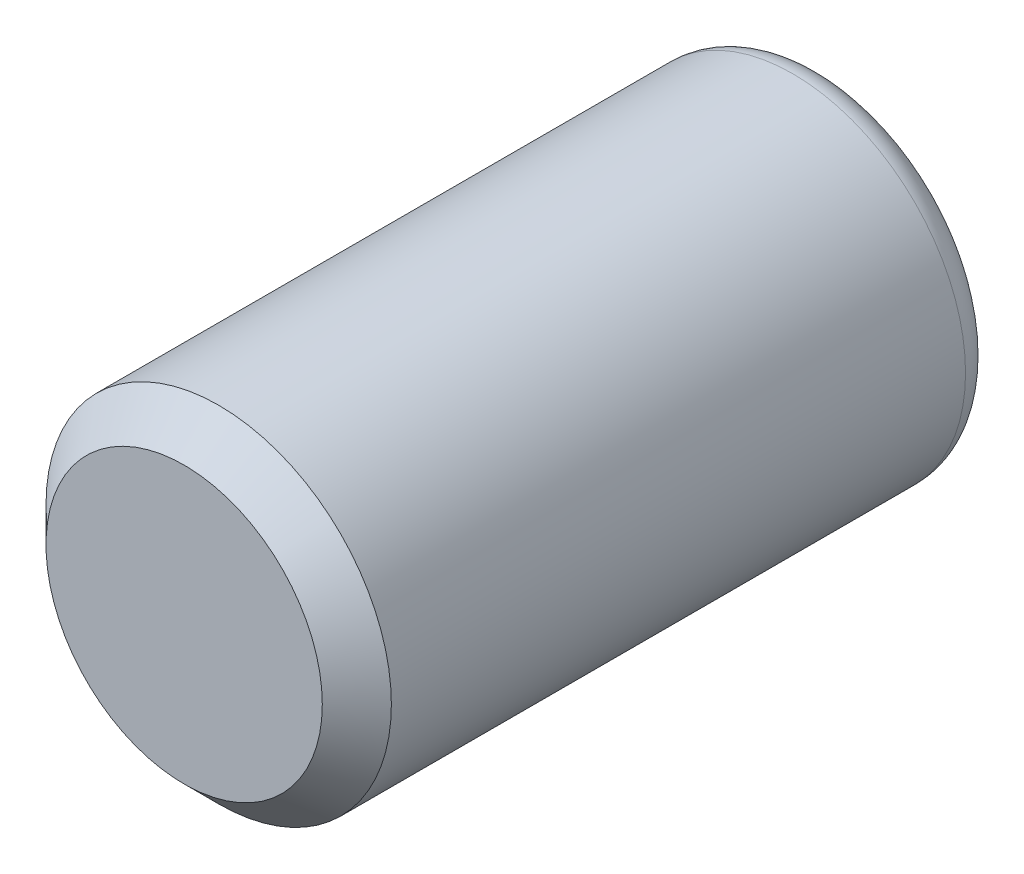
ISO-10303-21;
HEADER;
FILE_DESCRIPTION(('STEP AP214'),'2;1');
FILE_NAME('part.step','',(''),(''),'','','');
FILE_SCHEMA(('AUTOMOTIVE_DESIGN { 1 0 10303 214 1 1 1 1 }'));
ENDSEC;
DATA;
#1=APPLICATION_CONTEXT('core data for automotive mechanical design processes');
#2=APPLICATION_PROTOCOL_DEFINITION('international standard','automotive_design',2000,#1);
#3=PRODUCT_CONTEXT('',#1,'mechanical');
#4=PRODUCT('Part','Part','',(#3));
#5=PRODUCT_RELATED_PRODUCT_CATEGORY('part','',(#4));
#6=PRODUCT_DEFINITION_FORMATION('','',#4);
#7=PRODUCT_DEFINITION_CONTEXT('part definition',#1,'design');
#8=PRODUCT_DEFINITION('design','',#6,#7);
#9=PRODUCT_DEFINITION_SHAPE('','',#8);
#10=(LENGTH_UNIT() NAMED_UNIT(*) SI_UNIT(.MILLI.,.METRE.));
#11=(NAMED_UNIT(*) PLANE_ANGLE_UNIT() SI_UNIT($,.RADIAN.));
#12=(NAMED_UNIT(*) SI_UNIT($,.STERADIAN.) SOLID_ANGLE_UNIT());
#13=UNCERTAINTY_MEASURE_WITH_UNIT(LENGTH_MEASURE(1.E-05),#10,'distance_accuracy_value','');
#14=(GEOMETRIC_REPRESENTATION_CONTEXT(3) GLOBAL_UNCERTAINTY_ASSIGNED_CONTEXT((#13)) GLOBAL_UNIT_ASSIGNED_CONTEXT((#10,
#11,#12)) REPRESENTATION_CONTEXT('',''));
#15=CARTESIAN_POINT('',(0.,0.,0.));
#16=DIRECTION('',(0.,0.,1.));
#17=DIRECTION('',(1.,0.,0.));
#18=AXIS2_PLACEMENT_3D('',#15,#16,#17);
#19=CARTESIAN_POINT('',(0.,0.,-7.));
#20=DIRECTION('',(0.,0.,1.));
#21=DIRECTION('',(1.,0.,0.));
#22=AXIS2_PLACEMENT_3D('',#19,#20,#21);
#23=PLANE('',#22);
#24=CARTESIAN_POINT('',(0.,0.,-7.));
#25=DIRECTION('',(0.,0.,-1.));
#26=DIRECTION('',(-1.,0.,0.));
#27=AXIS2_PLACEMENT_3D('',#24,#25,#26);
#28=CIRCLE('',#27,3.3);
#29=CARTESIAN_POINT('',(-3.3,0.,-7.));
#30=VERTEX_POINT('',#29);
#31=EDGE_CURVE('E133',#30,#30,#28,.T.);
#32=ORIENTED_EDGE('',*,*,#31,.T.);
#33=EDGE_LOOP('',(#32));
#34=FACE_BOUND('',#33,.T.);
#35=DIRECTION('',(-0.86602540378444,0.499999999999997,0.));
#36=VECTOR('',#35,1.);
#37=CARTESIAN_POINT('',(0.,2.3094010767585,-7.));
#38=LINE('',#37,#36);
#39=CARTESIAN_POINT('',(2.,1.15470053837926,-7.));
#40=VERTEX_POINT('',#39);
#41=CARTESIAN_POINT('',(0.,2.3094010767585,-7.));
#42=VERTEX_POINT('',#41);
#43=EDGE_CURVE('E43',#40,#42,#38,.T.);
#44=ORIENTED_EDGE('',*,*,#43,.T.);
#45=DIRECTION('',(-0.866025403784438,-0.500000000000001,0.));
#46=VECTOR('',#45,1.);
#47=CARTESIAN_POINT('',(0.,2.3094010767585,-7.));
#48=LINE('',#47,#46);
#49=CARTESIAN_POINT('',(-2.,1.15470053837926,-7.));
#50=VERTEX_POINT('',#49);
#51=EDGE_CURVE('E83',#42,#50,#48,.T.);
#52=ORIENTED_EDGE('',*,*,#51,.T.);
#53=DIRECTION('',(0.,-1.,0.));
#54=VECTOR('',#53,1.);
#55=CARTESIAN_POINT('',(-2.,-1.15470053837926,-7.));
#56=LINE('',#55,#54);
#57=CARTESIAN_POINT('',(-2.,-1.15470053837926,-7.));
#58=VERTEX_POINT('',#57);
#59=EDGE_CURVE('E91',#50,#58,#56,.T.);
#60=ORIENTED_EDGE('',*,*,#59,.T.);
#61=DIRECTION('',(0.866025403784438,-0.500000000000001,0.));
#62=VECTOR('',#61,1.);
#63=CARTESIAN_POINT('',(0.,-2.3094010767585,-7.));
#64=LINE('',#63,#62);
#65=CARTESIAN_POINT('',(0.,-2.3094010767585,-7.));
#66=VERTEX_POINT('',#65);
#67=EDGE_CURVE('E106',#58,#66,#64,.T.);
#68=ORIENTED_EDGE('',*,*,#67,.T.);
#69=DIRECTION('',(0.86602540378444,0.499999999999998,0.));
#70=VECTOR('',#69,1.);
#71=CARTESIAN_POINT('',(0.,-2.3094010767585,-7.));
#72=LINE('',#71,#70);
#73=CARTESIAN_POINT('',(2.,-1.15470053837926,-7.));
#74=VERTEX_POINT('',#73);
#75=EDGE_CURVE('E109',#66,#74,#72,.T.);
#76=ORIENTED_EDGE('',*,*,#75,.T.);
#77=DIRECTION('',(0.,1.,0.));
#78=VECTOR('',#77,1.);
#79=CARTESIAN_POINT('',(2.,-1.15470053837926,-7.));
#80=LINE('',#79,#78);
#81=EDGE_CURVE('E102',#74,#40,#80,.T.);
#82=ORIENTED_EDGE('',*,*,#81,.T.);
#83=EDGE_LOOP('',(#44,#52,#60,#68,#76,#82));
#84=FACE_BOUND('',#83,.T.);
#85=ADVANCED_FACE('F29',(#34,#84),#23,.F.);
#86=CARTESIAN_POINT('',(0.,0.,-6.3));
#87=DIRECTION('',(0.,0.,-1.));
#88=DIRECTION('',(-1.,0.,0.));
#89=AXIS2_PLACEMENT_3D('',#86,#87,#88);
#90=TOROIDAL_SURFACE('',#89,3.3,0.700000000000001);
#91=ORIENTED_EDGE('',*,*,#31,.F.);
#92=EDGE_LOOP('',(#91));
#93=FACE_BOUND('',#92,.T.);
#94=CARTESIAN_POINT('',(0.,0.,-6.3));
#95=DIRECTION('',(0.,0.,-1.));
#96=DIRECTION('',(-1.,0.,0.));
#97=AXIS2_PLACEMENT_3D('',#94,#95,#96);
#98=CIRCLE('',#97,4.);
#99=CARTESIAN_POINT('',(-4.,0.,-6.3));
#100=VERTEX_POINT('',#99);
#101=EDGE_CURVE('E97',#100,#100,#98,.T.);
#102=ORIENTED_EDGE('',*,*,#101,.T.);
#103=EDGE_LOOP('',(#102));
#104=FACE_BOUND('',#103,.T.);
#105=ADVANCED_FACE('F151',(#93,#104),#90,.T.);
#106=CARTESIAN_POINT('',(0.,0.,0.));
#107=DIRECTION('',(0.,0.,-1.));
#108=DIRECTION('',(-1.,0.,0.));
#109=AXIS2_PLACEMENT_3D('',#106,#107,#108);
#110=CYLINDRICAL_SURFACE('',#109,4.);
#111=CARTESIAN_POINT('',(0.,0.,7.));
#112=DIRECTION('',(0.,0.,1.));
#113=DIRECTION('',(1.,0.,0.));
#114=AXIS2_PLACEMENT_3D('',#111,#112,#113);
#115=CIRCLE('',#114,4.);
#116=CARTESIAN_POINT('',(4.,0.,7.));
#117=VERTEX_POINT('',#116);
#118=EDGE_CURVE('E11',#117,#117,#115,.F.);
#119=ORIENTED_EDGE('',*,*,#118,.T.);
#120=EDGE_LOOP('',(#119));
#121=FACE_BOUND('',#120,.T.);
#122=ORIENTED_EDGE('',*,*,#101,.F.);
#123=EDGE_LOOP('',(#122));
#124=FACE_BOUND('',#123,.T.);
#125=ADVANCED_FACE('F156',(#121,#124),#110,.T.);
#126=CARTESIAN_POINT('',(0.,2.3094010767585,-4.));
#127=DIRECTION('',(-0.499999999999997,-0.86602540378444,0.));
#128=DIRECTION('',(0.86602540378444,-0.499999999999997,0.));
#129=AXIS2_PLACEMENT_3D('',#126,#127,#128);
#130=PLANE('',#129);
#131=ORIENTED_EDGE('',*,*,#43,.F.);
#132=DIRECTION('',(0.,0.,-1.));
#133=VECTOR('',#132,1.);
#134=CARTESIAN_POINT('',(2.,1.15470053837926,-4.));
#135=LINE('',#134,#133);
#136=CARTESIAN_POINT('',(2.,1.15470053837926,-4.));
#137=VERTEX_POINT('',#136);
#138=EDGE_CURVE('E122',#137,#40,#135,.T.);
#139=ORIENTED_EDGE('',*,*,#138,.F.);
#140=DIRECTION('',(-0.86602540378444,0.499999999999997,0.));
#141=VECTOR('',#140,1.);
#142=CARTESIAN_POINT('',(0.,2.3094010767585,-4.));
#143=LINE('',#142,#141);
#144=CARTESIAN_POINT('',(0.,2.3094010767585,-4.));
#145=VERTEX_POINT('',#144);
#146=EDGE_CURVE('E96',#137,#145,#143,.T.);
#147=ORIENTED_EDGE('',*,*,#146,.T.);
#148=DIRECTION('',(0.,0.,-1.));
#149=VECTOR('',#148,1.);
#150=CARTESIAN_POINT('',(0.,2.3094010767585,-4.));
#151=LINE('',#150,#149);
#152=EDGE_CURVE('E85',#145,#42,#151,.T.);
#153=ORIENTED_EDGE('',*,*,#152,.T.);
#154=EDGE_LOOP('',(#131,#139,#147,#153));
#155=FACE_BOUND('',#154,.T.);
#156=ADVANCED_FACE('F94',(#155),#130,.T.);
#157=CARTESIAN_POINT('',(0.,2.3094010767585,-4.));
#158=DIRECTION('',(0.500000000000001,-0.866025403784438,0.));
#159=DIRECTION('',(0.866025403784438,0.500000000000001,0.));
#160=AXIS2_PLACEMENT_3D('',#157,#158,#159);
#161=PLANE('',#160);
#162=ORIENTED_EDGE('',*,*,#51,.F.);
#163=ORIENTED_EDGE('',*,*,#152,.F.);
#164=DIRECTION('',(-0.866025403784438,-0.500000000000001,0.));
#165=VECTOR('',#164,1.);
#166=CARTESIAN_POINT('',(0.,2.3094010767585,-4.));
#167=LINE('',#166,#165);
#168=CARTESIAN_POINT('',(-2.,1.15470053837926,-4.));
#169=VERTEX_POINT('',#168);
#170=EDGE_CURVE('E113',#145,#169,#167,.T.);
#171=ORIENTED_EDGE('',*,*,#170,.T.);
#172=DIRECTION('',(0.,0.,-1.));
#173=VECTOR('',#172,1.);
#174=CARTESIAN_POINT('',(-2.,1.15470053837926,-4.));
#175=LINE('',#174,#173);
#176=EDGE_CURVE('E87',#169,#50,#175,.T.);
#177=ORIENTED_EDGE('',*,*,#176,.T.);
#178=EDGE_LOOP('',(#162,#163,#171,#177));
#179=FACE_BOUND('',#178,.T.);
#180=ADVANCED_FACE('F84',(#179),#161,.T.);
#181=CARTESIAN_POINT('',(-2.,-1.15470053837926,-4.));
#182=DIRECTION('',(1.,0.,0.));
#183=DIRECTION('',(0.,0.,-1.));
#184=AXIS2_PLACEMENT_3D('',#181,#182,#183);
#185=PLANE('',#184);
#186=ORIENTED_EDGE('',*,*,#59,.F.);
#187=ORIENTED_EDGE('',*,*,#176,.F.);
#188=DIRECTION('',(0.,-1.,0.));
#189=VECTOR('',#188,1.);
#190=CARTESIAN_POINT('',(-2.,-1.15470053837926,-4.));
#191=LINE('',#190,#189);
#192=CARTESIAN_POINT('',(-2.,-1.15470053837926,-4.));
#193=VERTEX_POINT('',#192);
#194=EDGE_CURVE('E115',#169,#193,#191,.T.);
#195=ORIENTED_EDGE('',*,*,#194,.T.);
#196=DIRECTION('',(0.,0.,-1.));
#197=VECTOR('',#196,1.);
#198=CARTESIAN_POINT('',(-2.,-1.15470053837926,-4.));
#199=LINE('',#198,#197);
#200=EDGE_CURVE('E128',#193,#58,#199,.T.);
#201=ORIENTED_EDGE('',*,*,#200,.T.);
#202=EDGE_LOOP('',(#186,#187,#195,#201));
#203=FACE_BOUND('',#202,.T.);
#204=ADVANCED_FACE('F172',(#203),#185,.T.);
#205=CARTESIAN_POINT('',(0.,-2.3094010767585,-4.));
#206=DIRECTION('',(0.500000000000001,0.866025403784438,0.));
#207=DIRECTION('',(-0.866025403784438,0.500000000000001,0.));
#208=AXIS2_PLACEMENT_3D('',#205,#206,#207);
#209=PLANE('',#208);
#210=ORIENTED_EDGE('',*,*,#67,.F.);
#211=ORIENTED_EDGE('',*,*,#200,.F.);
#212=DIRECTION('',(0.866025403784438,-0.500000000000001,0.));
#213=VECTOR('',#212,1.);
#214=CARTESIAN_POINT('',(0.,-2.3094010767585,-4.));
#215=LINE('',#214,#213);
#216=CARTESIAN_POINT('',(0.,-2.3094010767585,-4.));
#217=VERTEX_POINT('',#216);
#218=EDGE_CURVE('E117',#193,#217,#215,.T.);
#219=ORIENTED_EDGE('',*,*,#218,.T.);
#220=DIRECTION('',(0.,0.,-1.));
#221=VECTOR('',#220,1.);
#222=CARTESIAN_POINT('',(0.,-2.3094010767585,-4.));
#223=LINE('',#222,#221);
#224=EDGE_CURVE('E126',#217,#66,#223,.T.);
#225=ORIENTED_EDGE('',*,*,#224,.T.);
#226=EDGE_LOOP('',(#210,#211,#219,#225));
#227=FACE_BOUND('',#226,.T.);
#228=ADVANCED_FACE('F175',(#227),#209,.T.);
#229=CARTESIAN_POINT('',(0.,-2.3094010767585,-4.));
#230=DIRECTION('',(-0.499999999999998,0.86602540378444,0.));
#231=DIRECTION('',(-0.86602540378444,-0.499999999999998,0.));
#232=AXIS2_PLACEMENT_3D('',#229,#230,#231);
#233=PLANE('',#232);
#234=ORIENTED_EDGE('',*,*,#75,.F.);
#235=ORIENTED_EDGE('',*,*,#224,.F.);
#236=DIRECTION('',(0.86602540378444,0.499999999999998,0.));
#237=VECTOR('',#236,1.);
#238=CARTESIAN_POINT('',(0.,-2.3094010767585,-4.));
#239=LINE('',#238,#237);
#240=CARTESIAN_POINT('',(2.,-1.15470053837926,-4.));
#241=VERTEX_POINT('',#240);
#242=EDGE_CURVE('E119',#217,#241,#239,.T.);
#243=ORIENTED_EDGE('',*,*,#242,.T.);
#244=DIRECTION('',(0.,0.,-1.));
#245=VECTOR('',#244,1.);
#246=CARTESIAN_POINT('',(2.,-1.15470053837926,-4.));
#247=LINE('',#246,#245);
#248=EDGE_CURVE('E124',#241,#74,#247,.T.);
#249=ORIENTED_EDGE('',*,*,#248,.T.);
#250=EDGE_LOOP('',(#234,#235,#243,#249));
#251=FACE_BOUND('',#250,.T.);
#252=ADVANCED_FACE('F179',(#251),#233,.T.);
#253=CARTESIAN_POINT('',(2.,-1.15470053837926,-4.));
#254=DIRECTION('',(-1.,0.,0.));
#255=DIRECTION('',(0.,-1.,0.));
#256=AXIS2_PLACEMENT_3D('',#253,#254,#255);
#257=PLANE('',#256);
#258=ORIENTED_EDGE('',*,*,#81,.F.);
#259=ORIENTED_EDGE('',*,*,#248,.F.);
#260=DIRECTION('',(0.,1.,0.));
#261=VECTOR('',#260,1.);
#262=CARTESIAN_POINT('',(2.,-1.15470053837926,-4.));
#263=LINE('',#262,#261);
#264=EDGE_CURVE('E50',#241,#137,#263,.T.);
#265=ORIENTED_EDGE('',*,*,#264,.T.);
#266=ORIENTED_EDGE('',*,*,#138,.T.);
#267=EDGE_LOOP('',(#258,#259,#265,#266));
#268=FACE_BOUND('',#267,.T.);
#269=ADVANCED_FACE('F183',(#268),#257,.T.);
#270=CARTESIAN_POINT('',(2.,1.15470053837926,-4.));
#271=DIRECTION('',(0.,0.,1.));
#272=DIRECTION('',(1.,0.,0.));
#273=AXIS2_PLACEMENT_3D('',#270,#271,#272);
#274=PLANE('',#273);
#275=ORIENTED_EDGE('',*,*,#146,.F.);
#276=ORIENTED_EDGE('',*,*,#264,.F.);
#277=ORIENTED_EDGE('',*,*,#242,.F.);
#278=ORIENTED_EDGE('',*,*,#218,.F.);
#279=ORIENTED_EDGE('',*,*,#194,.F.);
#280=ORIENTED_EDGE('',*,*,#170,.F.);
#281=EDGE_LOOP('',(#275,#276,#277,#278,#279,#280));
#282=FACE_BOUND('',#281,.T.);
#283=ADVANCED_FACE('F147',(#282),#274,.F.);
#284=CARTESIAN_POINT('',(0.,0.,7.8));
#285=DIRECTION('',(0.,0.,1.));
#286=DIRECTION('',(1.,0.,0.));
#287=AXIS2_PLACEMENT_3D('',#284,#285,#286);
#288=PLANE('',#287);
#289=CARTESIAN_POINT('',(0.,0.,7.8));
#290=DIRECTION('',(0.,0.,1.));
#291=DIRECTION('',(1.,0.,0.));
#292=AXIS2_PLACEMENT_3D('',#289,#290,#291);
#293=CIRCLE('',#292,3.2);
#294=CARTESIAN_POINT('',(3.2,0.,7.8));
#295=VERTEX_POINT('',#294);
#296=EDGE_CURVE('E36',#295,#295,#293,.T.);
#297=ORIENTED_EDGE('',*,*,#296,.T.);
#298=EDGE_LOOP('',(#297));
#299=FACE_BOUND('',#298,.T.);
#300=ADVANCED_FACE('F138',(#299),#288,.T.);
#301=CARTESIAN_POINT('',(0.,0.,7.8));
#302=DIRECTION('',(0.,0.,-1.));
#303=DIRECTION('',(-1.,0.,0.));
#304=AXIS2_PLACEMENT_3D('',#301,#302,#303);
#305=CONICAL_SURFACE('',#304,3.2,0.785398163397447);
#306=ORIENTED_EDGE('',*,*,#118,.F.);
#307=EDGE_LOOP('',(#306));
#308=FACE_BOUND('',#307,.T.);
#309=ORIENTED_EDGE('',*,*,#296,.F.);
#310=EDGE_LOOP('',(#309));
#311=FACE_BOUND('',#310,.T.);
#312=ADVANCED_FACE('F140',(#308,#311),#305,.T.);
#313=CLOSED_SHELL('',(#85,#105,#125,#156,#180,#204,#228,#252,#269,#283,#300,#312));
#314=MANIFOLD_SOLID_BREP('B2',#313);
#315=ADVANCED_BREP_SHAPE_REPRESENTATION('',(#18,#314),#14);
#316=SHAPE_DEFINITION_REPRESENTATION(#9,#315);
ENDSEC;
END-ISO-10303-21;
